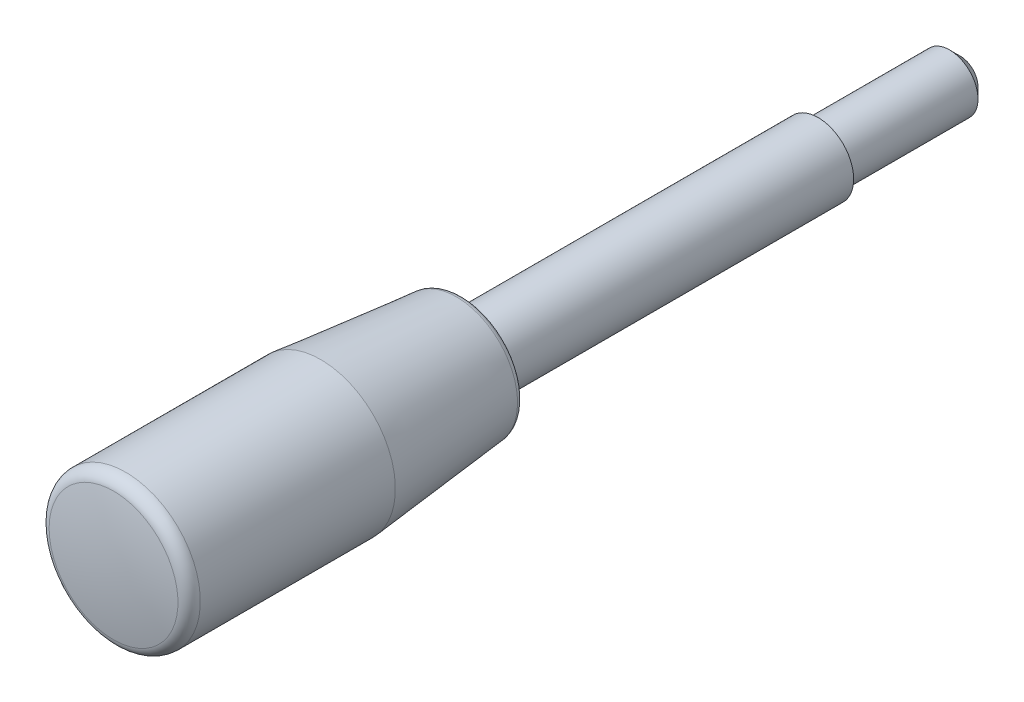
ISO-10303-21;
HEADER;
FILE_DESCRIPTION(('STEP AP214'),'2;1');
FILE_NAME('part.step','',(''),(''),'','','');
FILE_SCHEMA(('AUTOMOTIVE_DESIGN { 1 0 10303 214 1 1 1 1 }'));
ENDSEC;
DATA;
#1=APPLICATION_CONTEXT('core data for automotive mechanical design processes');
#2=APPLICATION_PROTOCOL_DEFINITION('international standard','automotive_design',2000,#1);
#3=PRODUCT_CONTEXT('',#1,'mechanical');
#4=PRODUCT('Part','Part','',(#3));
#5=PRODUCT_RELATED_PRODUCT_CATEGORY('part','',(#4));
#6=PRODUCT_DEFINITION_FORMATION('','',#4);
#7=PRODUCT_DEFINITION_CONTEXT('part definition',#1,'design');
#8=PRODUCT_DEFINITION('design','',#6,#7);
#9=PRODUCT_DEFINITION_SHAPE('','',#8);
#10=(LENGTH_UNIT() NAMED_UNIT(*) SI_UNIT(.MILLI.,.METRE.));
#11=(NAMED_UNIT(*) PLANE_ANGLE_UNIT() SI_UNIT($,.RADIAN.));
#12=(NAMED_UNIT(*) SI_UNIT($,.STERADIAN.) SOLID_ANGLE_UNIT());
#13=UNCERTAINTY_MEASURE_WITH_UNIT(LENGTH_MEASURE(1.E-05),#10,'distance_accuracy_value','');
#14=(GEOMETRIC_REPRESENTATION_CONTEXT(3) GLOBAL_UNCERTAINTY_ASSIGNED_CONTEXT((#13)) GLOBAL_UNIT_ASSIGNED_CONTEXT((#10,
#11,#12)) REPRESENTATION_CONTEXT('',''));
#15=CARTESIAN_POINT('',(0.,0.,0.));
#16=DIRECTION('',(0.,0.,1.));
#17=DIRECTION('',(1.,0.,0.));
#18=AXIS2_PLACEMENT_3D('',#15,#16,#17);
#19=CARTESIAN_POINT('',(0.,0.,-31.4747736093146));
#20=DIRECTION('',(0.,0.,-1.));
#21=DIRECTION('',(-1.,0.,0.));
#22=AXIS2_PLACEMENT_3D('',#19,#20,#21);
#23=CYLINDRICAL_SURFACE('',#22,4.);
#24=CARTESIAN_POINT('',(0.,0.,-18.5));
#25=DIRECTION('',(0.,0.,-1.));
#26=DIRECTION('',(-1.,0.,0.));
#27=AXIS2_PLACEMENT_3D('',#24,#25,#26);
#28=CIRCLE('',#27,4.);
#29=CARTESIAN_POINT('',(-4.,0.,-18.5));
#30=VERTEX_POINT('',#29);
#31=EDGE_CURVE('E8',#30,#30,#28,.T.);
#32=ORIENTED_EDGE('',*,*,#31,.F.);
#33=EDGE_LOOP('',(#32));
#34=FACE_BOUND('',#33,.T.);
#35=CARTESIAN_POINT('',(0.,0.,0.));
#36=DIRECTION('',(0.,0.,-1.));
#37=DIRECTION('',(-1.,0.,0.));
#38=AXIS2_PLACEMENT_3D('',#35,#36,#37);
#39=CIRCLE('',#38,4.);
#40=CARTESIAN_POINT('',(-4.,0.,0.));
#41=VERTEX_POINT('',#40);
#42=EDGE_CURVE('E46',#41,#41,#39,.T.);
#43=ORIENTED_EDGE('',*,*,#42,.T.);
#44=EDGE_LOOP('',(#43));
#45=FACE_BOUND('',#44,.T.);
#46=ADVANCED_FACE('F12',(#34,#45),#23,.T.);
#47=CARTESIAN_POINT('',(0.,0.,-18.5));
#48=DIRECTION('',(0.,0.,1.));
#49=DIRECTION('',(1.,0.,0.));
#50=AXIS2_PLACEMENT_3D('',#47,#48,#49);
#51=CONICAL_SURFACE('',#50,4.,0.785398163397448);
#52=CARTESIAN_POINT('',(0.,0.,-20.));
#53=DIRECTION('',(0.,0.,-1.));
#54=DIRECTION('',(-1.,0.,0.));
#55=AXIS2_PLACEMENT_3D('',#52,#53,#54);
#56=CIRCLE('',#55,2.5);
#57=CARTESIAN_POINT('',(-2.5,0.,-20.));
#58=VERTEX_POINT('',#57);
#59=EDGE_CURVE('E18',#58,#58,#56,.T.);
#60=ORIENTED_EDGE('',*,*,#59,.F.);
#61=EDGE_LOOP('',(#60));
#62=FACE_BOUND('',#61,.T.);
#63=ORIENTED_EDGE('',*,*,#31,.T.);
#64=EDGE_LOOP('',(#63));
#65=FACE_BOUND('',#64,.T.);
#66=ADVANCED_FACE('F102',(#62,#65),#51,.T.);
#67=CARTESIAN_POINT('',(0.,2.49999999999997,-20.));
#68=DIRECTION('',(0.,0.,1.));
#69=DIRECTION('',(1.,0.,0.));
#70=AXIS2_PLACEMENT_3D('',#67,#68,#69);
#71=PLANE('',#70);
#72=ORIENTED_EDGE('',*,*,#59,.T.);
#73=EDGE_LOOP('',(#72));
#74=FACE_BOUND('',#73,.T.);
#75=ADVANCED_FACE('F95',(#74),#71,.F.);
#76=CARTESIAN_POINT('',(0.,0.,50.));
#77=DIRECTION('',(-1.,0.,0.));
#78=DIRECTION('',(0.,0.,1.));
#79=AXIS2_PLACEMENT_3D('',#76,#77,#78);
#80=SPHERICAL_SURFACE('',#79,50.);
#81=CARTESIAN_POINT('',(0.,0.,50.));
#82=DIRECTION('',(0.,0.,-1.));
#83=DIRECTION('',(-1.,0.,0.));
#84=AXIS2_PLACEMENT_3D('',#81,#82,#83);
#85=SPHERICAL_SURFACE('',#84,50.);
#86=CARTESIAN_POINT('',(0.,0.,99.170957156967));
#87=DIRECTION('',(0.,0.,-1.));
#88=DIRECTION('',(-1.,0.,0.));
#89=AXIS2_PLACEMENT_3D('',#86,#87,#88);
#90=CIRCLE('',#89,9.06735751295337);
#91=CARTESIAN_POINT('',(-9.06735751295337,0.,99.170957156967));
#92=VERTEX_POINT('',#91);
#93=EDGE_CURVE('E22',#92,#92,#90,.T.);
#94=ORIENTED_EDGE('',*,*,#93,.F.);
#95=EDGE_LOOP('',(#94));
#96=FACE_BOUND('',#95,.T.);
#97=ADVANCED_FACE('F90',(#96),#85,.T.);
#98=CARTESIAN_POINT('',(0.,0.,97.449973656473));
#99=DIRECTION('',(0.,0.,-1.));
#100=DIRECTION('',(-1.,0.,0.));
#101=AXIS2_PLACEMENT_3D('',#98,#99,#100);
#102=TOROIDAL_SURFACE('',#101,8.75,1.75);
#103=CARTESIAN_POINT('',(0.,0.,97.449973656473));
#104=DIRECTION('',(0.,0.,-1.));
#105=DIRECTION('',(-1.,0.,0.));
#106=AXIS2_PLACEMENT_3D('',#103,#104,#105);
#107=CIRCLE('',#106,10.5);
#108=CARTESIAN_POINT('',(-10.5,0.,97.449973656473));
#109=VERTEX_POINT('',#108);
#110=EDGE_CURVE('E26',#109,#109,#107,.T.);
#111=ORIENTED_EDGE('',*,*,#110,.F.);
#112=EDGE_LOOP('',(#111));
#113=FACE_BOUND('',#112,.T.);
#114=ORIENTED_EDGE('',*,*,#93,.T.);
#115=EDGE_LOOP('',(#114));
#116=FACE_BOUND('',#115,.T.);
#117=ADVANCED_FACE('F84',(#113,#116),#102,.T.);
#118=CARTESIAN_POINT('',(0.,0.,-31.4747736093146));
#119=DIRECTION('',(0.,0.,-1.));
#120=DIRECTION('',(-1.,0.,0.));
#121=AXIS2_PLACEMENT_3D('',#118,#119,#120);
#122=CYLINDRICAL_SURFACE('',#121,10.5);
#123=CARTESIAN_POINT('',(0.,0.,70.));
#124=DIRECTION('',(0.,0.,-1.));
#125=DIRECTION('',(-1.,0.,0.));
#126=AXIS2_PLACEMENT_3D('',#123,#124,#125);
#127=CIRCLE('',#126,10.5);
#128=CARTESIAN_POINT('',(-10.5,0.,70.));
#129=VERTEX_POINT('',#128);
#130=EDGE_CURVE('E31',#129,#129,#127,.T.);
#131=ORIENTED_EDGE('',*,*,#130,.F.);
#132=EDGE_LOOP('',(#131));
#133=FACE_BOUND('',#132,.T.);
#134=ORIENTED_EDGE('',*,*,#110,.T.);
#135=EDGE_LOOP('',(#134));
#136=FACE_BOUND('',#135,.T.);
#137=ADVANCED_FACE('F78',(#133,#136),#122,.T.);
#138=CARTESIAN_POINT('',(0.,0.,70.));
#139=DIRECTION('',(0.,0.,1.));
#140=DIRECTION('',(1.,0.,0.));
#141=AXIS2_PLACEMENT_3D('',#138,#139,#140);
#142=CONICAL_SURFACE('',#141,10.5,0.0996686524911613);
#143=CARTESIAN_POINT('',(0.,0.,50.900496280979));
#144=DIRECTION('',(0.,0.,-1.));
#145=DIRECTION('',(-1.,0.,0.));
#146=AXIS2_PLACEMENT_3D('',#143,#144,#145);
#147=CIRCLE('',#146,8.5900496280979);
#148=CARTESIAN_POINT('',(-8.5900496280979,0.,50.900496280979));
#149=VERTEX_POINT('',#148);
#150=EDGE_CURVE('E34',#149,#149,#147,.T.);
#151=ORIENTED_EDGE('',*,*,#150,.F.);
#152=EDGE_LOOP('',(#151));
#153=FACE_BOUND('',#152,.T.);
#154=ORIENTED_EDGE('',*,*,#130,.T.);
#155=EDGE_LOOP('',(#154));
#156=FACE_BOUND('',#155,.T.);
#157=ADVANCED_FACE('F72',(#153,#156),#142,.T.);
#158=CARTESIAN_POINT('',(0.,0.,51.));
#159=DIRECTION('',(0.,0.,-1.));
#160=DIRECTION('',(-1.,0.,0.));
#161=AXIS2_PLACEMENT_3D('',#158,#159,#160);
#162=TOROIDAL_SURFACE('',#161,7.59501243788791,0.999999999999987);
#163=CARTESIAN_POINT('',(0.,0.,50.));
#164=DIRECTION('',(0.,0.,-1.));
#165=DIRECTION('',(-1.,0.,0.));
#166=AXIS2_PLACEMENT_3D('',#163,#164,#165);
#167=CIRCLE('',#166,7.59501243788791);
#168=CARTESIAN_POINT('',(-7.59501243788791,0.,50.));
#169=VERTEX_POINT('',#168);
#170=EDGE_CURVE('E37',#169,#169,#167,.T.);
#171=ORIENTED_EDGE('',*,*,#170,.F.);
#172=EDGE_LOOP('',(#171));
#173=FACE_BOUND('',#172,.T.);
#174=ORIENTED_EDGE('',*,*,#150,.T.);
#175=EDGE_LOOP('',(#174));
#176=FACE_BOUND('',#175,.T.);
#177=ADVANCED_FACE('F66',(#173,#176),#162,.T.);
#178=CARTESIAN_POINT('',(0.,7.59501243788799,50.));
#179=DIRECTION('',(0.,0.,1.));
#180=DIRECTION('',(1.,0.,0.));
#181=AXIS2_PLACEMENT_3D('',#178,#179,#180);
#182=PLANE('',#181);
#183=CARTESIAN_POINT('',(0.,0.,50.));
#184=DIRECTION('',(0.,0.,-1.));
#185=DIRECTION('',(-1.,0.,0.));
#186=AXIS2_PLACEMENT_3D('',#183,#184,#185);
#187=CIRCLE('',#186,5.);
#188=CARTESIAN_POINT('',(-5.,0.,50.));
#189=VERTEX_POINT('',#188);
#190=EDGE_CURVE('E40',#189,#189,#187,.T.);
#191=ORIENTED_EDGE('',*,*,#190,.F.);
#192=EDGE_LOOP('',(#191));
#193=FACE_BOUND('',#192,.T.);
#194=ORIENTED_EDGE('',*,*,#170,.T.);
#195=EDGE_LOOP('',(#194));
#196=FACE_BOUND('',#195,.T.);
#197=ADVANCED_FACE('F60',(#193,#196),#182,.F.);
#198=CARTESIAN_POINT('',(0.,0.,-31.4747736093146));
#199=DIRECTION('',(0.,0.,-1.));
#200=DIRECTION('',(-1.,0.,0.));
#201=AXIS2_PLACEMENT_3D('',#198,#199,#200);
#202=CYLINDRICAL_SURFACE('',#201,5.);
#203=CARTESIAN_POINT('',(0.,0.,0.));
#204=DIRECTION('',(0.,0.,-1.));
#205=DIRECTION('',(-1.,0.,0.));
#206=AXIS2_PLACEMENT_3D('',#203,#204,#205);
#207=CIRCLE('',#206,5.);
#208=CARTESIAN_POINT('',(-5.,0.,0.));
#209=VERTEX_POINT('',#208);
#210=EDGE_CURVE('E43',#209,#209,#207,.T.);
#211=ORIENTED_EDGE('',*,*,#210,.F.);
#212=EDGE_LOOP('',(#211));
#213=FACE_BOUND('',#212,.T.);
#214=ORIENTED_EDGE('',*,*,#190,.T.);
#215=EDGE_LOOP('',(#214));
#216=FACE_BOUND('',#215,.T.);
#217=ADVANCED_FACE('F54',(#213,#216),#202,.T.);
#218=CARTESIAN_POINT('',(0.,5.,0.));
#219=DIRECTION('',(0.,0.,1.));
#220=DIRECTION('',(1.,0.,0.));
#221=AXIS2_PLACEMENT_3D('',#218,#219,#220);
#222=PLANE('',#221);
#223=ORIENTED_EDGE('',*,*,#42,.F.);
#224=EDGE_LOOP('',(#223));
#225=FACE_BOUND('',#224,.T.);
#226=ORIENTED_EDGE('',*,*,#210,.T.);
#227=EDGE_LOOP('',(#226));
#228=FACE_BOUND('',#227,.T.);
#229=ADVANCED_FACE('F51',(#225,#228),#222,.F.);
#230=CLOSED_SHELL('',(#46,#66,#75,#97,#117,#137,#157,#177,#197,#217,#229));
#231=MANIFOLD_SOLID_BREP('B1',#230);
#232=ADVANCED_BREP_SHAPE_REPRESENTATION('',(#18,#231),#14);
#233=SHAPE_DEFINITION_REPRESENTATION(#9,#232);
ENDSEC;
END-ISO-10303-21;
